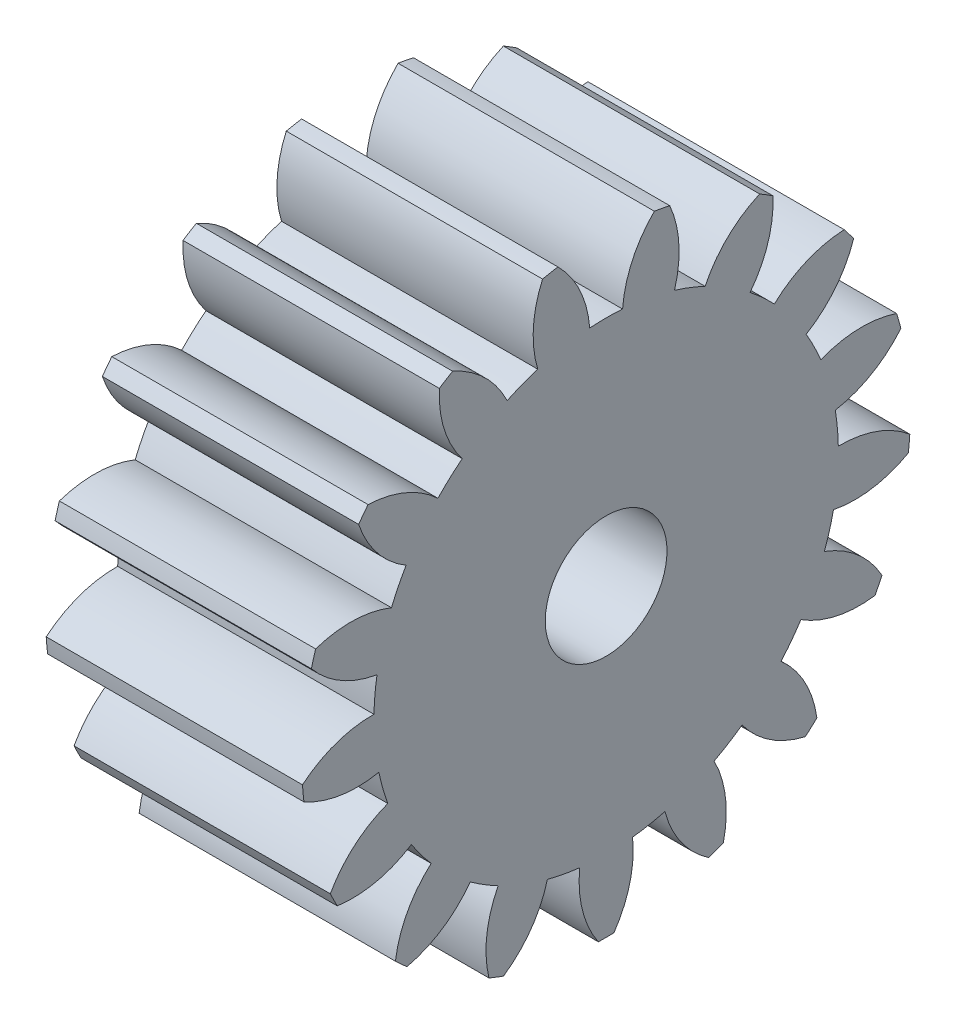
from build123d import *

# Parameters (mm, degrees)
BASPROSKE_W     = 12
BASPROSKE_H     = 14.25
TOOTHCUT_DEPTH  = 24.454743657
TEETHCUTS_COUNT = 17
TEETHCUTS_ANGLE = 338.823529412
BORSKE_R        = 2.85
BORE_DEPTH      = 50.0000508


with BuildPart() as part:
    # BasProSke → Base-Revolve (revolve)
    with BuildSketch(Plane(origin=(0, 0, 0), x_dir=(1, 0, 0), z_dir=(0, 1, 0)), mode=Mode.PRIVATE) as base_revolve_sk:
        with Locations((6, 7.125)):
            Rectangle(BASPROSKE_W, BASPROSKE_H)
    revolve(base_revolve_sk.sketch.rotate(Axis((-10, 0, 0), (1, 0, 0)), 180), axis=Axis((-10, 0, 0), (1, 0, 0)))

    # TooCutSke → ToothCut (cut, through all)
    with BuildSketch(Plane(origin=(0, 0, 0), x_dir=(0, 0, -1), z_dir=(1, 0, 0))):
        with BuildLine():
            ThreePointArc((0.769354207, 10.846749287), (0, 10.874), (-0.769354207, 10.846749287))
            ThreePointArc((-0.769354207, 10.846749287), (-1.230849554, 12.606357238), (-2.280560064, 14.092057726))
            ThreePointArc((-2.280560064, 14.092057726), (0, 14.2754), (2.280560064, 14.092057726))
            ThreePointArc((2.280560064, 14.092057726), (1.230849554, 12.606357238), (0.769354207, 10.846749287))
        make_face()
    toothcut = extrude(amount=TOOTHCUT_DEPTH, mode=Mode.SUBTRACT)

    # TeethCuts: ToothCut ×17 about axis
    teethcuts_axis = Axis((-10, 0, 0), (1, 0, 0))
    for i in range(1, TEETHCUTS_COUNT):
        add(toothcut.rotate(teethcuts_axis, i * TEETHCUTS_ANGLE / (TEETHCUTS_COUNT - 1)), mode=Mode.SUBTRACT)

    # BorSke → Bore (cut, symmetric)
    with BuildSketch(Plane(origin=(0, 0, 0), x_dir=(0, 0, -1), z_dir=(1, 0, 0))):
        with Locations(Location((0, 0, 0), (0, 0, 180))):
            Circle(BORSKE_R)
    extrude(amount=BORE_DEPTH, both=True, mode=Mode.SUBTRACT)


solid = part.part
